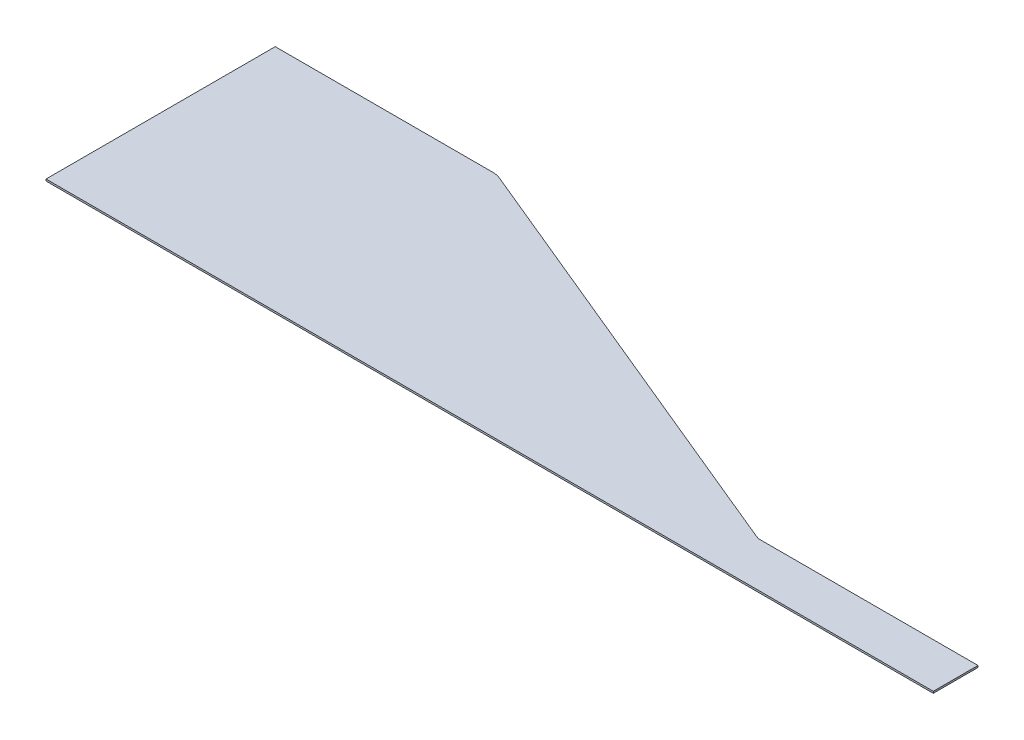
ISO-10303-21;
HEADER;
FILE_DESCRIPTION(('STEP AP214'),'2;1');
FILE_NAME('part.step','',(''),(''),'','','');
FILE_SCHEMA(('AUTOMOTIVE_DESIGN { 1 0 10303 214 1 1 1 1 }'));
ENDSEC;
DATA;
#1=APPLICATION_CONTEXT('core data for automotive mechanical design processes');
#2=APPLICATION_PROTOCOL_DEFINITION('international standard','automotive_design',2000,#1);
#3=PRODUCT_CONTEXT('',#1,'mechanical');
#4=PRODUCT('Part','Part','',(#3));
#5=PRODUCT_RELATED_PRODUCT_CATEGORY('part','',(#4));
#6=PRODUCT_DEFINITION_FORMATION('','',#4);
#7=PRODUCT_DEFINITION_CONTEXT('part definition',#1,'design');
#8=PRODUCT_DEFINITION('design','',#6,#7);
#9=PRODUCT_DEFINITION_SHAPE('','',#8);
#10=(LENGTH_UNIT() NAMED_UNIT(*) SI_UNIT(.MILLI.,.METRE.));
#11=(NAMED_UNIT(*) PLANE_ANGLE_UNIT() SI_UNIT($,.RADIAN.));
#12=(NAMED_UNIT(*) SI_UNIT($,.STERADIAN.) SOLID_ANGLE_UNIT());
#13=UNCERTAINTY_MEASURE_WITH_UNIT(LENGTH_MEASURE(1.E-05),#10,'distance_accuracy_value','');
#14=(GEOMETRIC_REPRESENTATION_CONTEXT(3) GLOBAL_UNCERTAINTY_ASSIGNED_CONTEXT((#13)) GLOBAL_UNIT_ASSIGNED_CONTEXT((#10,
#11,#12)) REPRESENTATION_CONTEXT('',''));
#15=CARTESIAN_POINT('',(0.,0.,0.));
#16=DIRECTION('',(0.,0.,1.));
#17=DIRECTION('',(1.,0.,0.));
#18=AXIS2_PLACEMENT_3D('',#15,#16,#17);
#19=CARTESIAN_POINT('',(0.,250.,300.));
#20=DIRECTION('',(0.,1.,0.));
#21=DIRECTION('',(0.,0.,1.));
#22=AXIS2_PLACEMENT_3D('',#19,#20,#21);
#23=PLANE('',#22);
#24=DIRECTION('',(1.,0.,0.));
#25=VECTOR('',#24,1.);
#26=CARTESIAN_POINT('',(0.,250.,300.));
#27=LINE('',#26,#25);
#28=CARTESIAN_POINT('',(-245.98048628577,250.,300.));
#29=VERTEX_POINT('',#28);
#30=CARTESIAN_POINT('',(745.98048628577,250.,300.));
#31=VERTEX_POINT('',#30);
#32=EDGE_CURVE('E161',#29,#31,#27,.T.);
#33=ORIENTED_EDGE('',*,*,#32,.T.);
#34=DIRECTION('',(0.,0.,-1.));
#35=VECTOR('',#34,1.);
#36=CARTESIAN_POINT('',(745.98048628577,250.,300.));
#37=LINE('',#36,#35);
#38=CARTESIAN_POINT('',(745.98048628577,250.,250.));
#39=VERTEX_POINT('',#38);
#40=EDGE_CURVE('E128',#31,#39,#37,.T.);
#41=ORIENTED_EDGE('',*,*,#40,.T.);
#42=DIRECTION('',(1.,0.,0.));
#43=VECTOR('',#42,1.);
#44=CARTESIAN_POINT('',(-297.055609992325,250.,250.));
#45=LINE('',#44,#43);
#46=CARTESIAN_POINT('',(500.58048628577,250.,250.));
#47=VERTEX_POINT('',#46);
#48=EDGE_CURVE('E122',#47,#39,#45,.T.);
#49=ORIENTED_EDGE('',*,*,#48,.F.);
#50=DIRECTION('',(-0.938532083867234,0.,-0.345192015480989));
#51=VECTOR('',#50,1.);
#52=CARTESIAN_POINT('',(500.58048628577,250.,250.));
#53=LINE('',#52,#51);
#54=CARTESIAN_POINT('',(495.4,250.,248.094617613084));
#55=VERTEX_POINT('',#54);
#56=EDGE_CURVE('E125',#47,#55,#53,.T.);
#57=ORIENTED_EDGE('',*,*,#56,.T.);
#58=DIRECTION('',(0.923879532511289,0.,0.382683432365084));
#59=VECTOR('',#58,1.);
#60=CARTESIAN_POINT('',(90.9009742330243,250.,80.5456351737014));
#61=LINE('',#60,#59);
#62=CARTESIAN_POINT('',(4.6,250.,44.7986012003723));
#63=VERTEX_POINT('',#62);
#64=EDGE_CURVE('E157',#63,#55,#61,.T.);
#65=ORIENTED_EDGE('',*,*,#64,.F.);
#66=DIRECTION('',(-0.979067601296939,0.,-0.203535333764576));
#67=VECTOR('',#66,1.);
#68=CARTESIAN_POINT('',(4.6,250.,44.7986012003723));
#69=LINE('',#68,#67);
#70=CARTESIAN_POINT('',(-0.580486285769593,250.,43.7216459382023));
#71=VERTEX_POINT('',#70);
#72=EDGE_CURVE('E154',#63,#71,#69,.T.);
#73=ORIENTED_EDGE('',*,*,#72,.T.);
#74=DIRECTION('',(1.,0.,0.));
#75=VECTOR('',#74,1.);
#76=CARTESIAN_POINT('',(-245.98048628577,250.,43.7216459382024));
#77=LINE('',#76,#75);
#78=CARTESIAN_POINT('',(-245.98048628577,250.,43.7216459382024));
#79=VERTEX_POINT('',#78);
#80=EDGE_CURVE('E62',#79,#71,#77,.T.);
#81=ORIENTED_EDGE('',*,*,#80,.F.);
#82=DIRECTION('',(0.,0.,-1.));
#83=VECTOR('',#82,1.);
#84=CARTESIAN_POINT('',(-245.98048628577,250.,300.));
#85=LINE('',#84,#83);
#86=EDGE_CURVE('E138',#29,#79,#85,.T.);
#87=ORIENTED_EDGE('',*,*,#86,.F.);
#88=EDGE_LOOP('',(#33,#41,#49,#57,#65,#73,#81,#87));
#89=FACE_BOUND('',#88,.T.);
#90=ADVANCED_FACE('F39',(#89),#23,.T.);
#91=CARTESIAN_POINT('',(0.,248.,300.));
#92=DIRECTION('',(0.,1.,0.));
#93=DIRECTION('',(0.,0.,1.));
#94=AXIS2_PLACEMENT_3D('',#91,#92,#93);
#95=PLANE('',#94);
#96=DIRECTION('',(0.923879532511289,0.,0.382683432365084));
#97=VECTOR('',#96,1.);
#98=CARTESIAN_POINT('',(90.9009742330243,248.,80.5456351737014));
#99=LINE('',#98,#97);
#100=CARTESIAN_POINT('',(4.6,248.,44.7986012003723));
#101=VERTEX_POINT('',#100);
#102=CARTESIAN_POINT('',(495.4,248.,248.094617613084));
#103=VERTEX_POINT('',#102);
#104=EDGE_CURVE('E159',#101,#103,#99,.T.);
#105=ORIENTED_EDGE('',*,*,#104,.T.);
#106=DIRECTION('',(-0.938532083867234,0.,-0.345192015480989));
#107=VECTOR('',#106,1.);
#108=CARTESIAN_POINT('',(500.58048628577,248.,250.));
#109=LINE('',#108,#107);
#110=CARTESIAN_POINT('',(500.58048628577,248.,250.));
#111=VERTEX_POINT('',#110);
#112=EDGE_CURVE('E53',#111,#103,#109,.T.);
#113=ORIENTED_EDGE('',*,*,#112,.F.);
#114=DIRECTION('',(-1.,0.,0.));
#115=VECTOR('',#114,1.);
#116=CARTESIAN_POINT('',(495.98048628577,248.,250.));
#117=LINE('',#116,#115);
#118=CARTESIAN_POINT('',(745.98048628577,248.,250.));
#119=VERTEX_POINT('',#118);
#120=EDGE_CURVE('E129',#111,#119,#117,.F.);
#121=ORIENTED_EDGE('',*,*,#120,.T.);
#122=DIRECTION('',(0.,0.,-1.));
#123=VECTOR('',#122,1.);
#124=CARTESIAN_POINT('',(745.98048628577,248.,300.));
#125=LINE('',#124,#123);
#126=CARTESIAN_POINT('',(745.98048628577,248.,300.));
#127=VERTEX_POINT('',#126);
#128=EDGE_CURVE('E133',#127,#119,#125,.T.);
#129=ORIENTED_EDGE('',*,*,#128,.F.);
#130=DIRECTION('',(1.,0.,0.));
#131=VECTOR('',#130,1.);
#132=CARTESIAN_POINT('',(0.,248.,300.));
#133=LINE('',#132,#131);
#134=CARTESIAN_POINT('',(-245.98048628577,248.,300.));
#135=VERTEX_POINT('',#134);
#136=EDGE_CURVE('E94',#135,#127,#133,.T.);
#137=ORIENTED_EDGE('',*,*,#136,.F.);
#138=DIRECTION('',(0.,0.,-1.));
#139=VECTOR('',#138,1.);
#140=CARTESIAN_POINT('',(-245.98048628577,248.,300.));
#141=LINE('',#140,#139);
#142=CARTESIAN_POINT('',(-245.98048628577,248.,43.7216459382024));
#143=VERTEX_POINT('',#142);
#144=EDGE_CURVE('E143',#135,#143,#141,.T.);
#145=ORIENTED_EDGE('',*,*,#144,.T.);
#146=DIRECTION('',(1.,0.,0.));
#147=VECTOR('',#146,1.);
#148=CARTESIAN_POINT('',(-245.98048628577,248.,43.7216459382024));
#149=LINE('',#148,#147);
#150=CARTESIAN_POINT('',(-0.580486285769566,248.,43.7216459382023));
#151=VERTEX_POINT('',#150);
#152=EDGE_CURVE('E97',#143,#151,#149,.T.);
#153=ORIENTED_EDGE('',*,*,#152,.T.);
#154=DIRECTION('',(-0.979067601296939,0.,-0.203535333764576));
#155=VECTOR('',#154,1.);
#156=CARTESIAN_POINT('',(4.6,248.,44.7986012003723));
#157=LINE('',#156,#155);
#158=EDGE_CURVE('E145',#101,#151,#157,.T.);
#159=ORIENTED_EDGE('',*,*,#158,.F.);
#160=EDGE_LOOP('',(#105,#113,#121,#129,#137,#145,#153,#159));
#161=FACE_BOUND('',#160,.T.);
#162=ADVANCED_FACE('F171',(#161),#95,.F.);
#163=CARTESIAN_POINT('',(2.,245.4,300.));
#164=DIRECTION('',(0.,0.,1.));
#165=DIRECTION('',(1.,0.,0.));
#166=AXIS2_PLACEMENT_3D('',#163,#164,#165);
#167=PLANE('',#166);
#168=ORIENTED_EDGE('',*,*,#32,.F.);
#169=DIRECTION('',(0.,1.,0.));
#170=VECTOR('',#169,1.);
#171=CARTESIAN_POINT('',(-245.98048628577,248.,300.));
#172=LINE('',#171,#170);
#173=EDGE_CURVE('E149',#135,#29,#172,.T.);
#174=ORIENTED_EDGE('',*,*,#173,.F.);
#175=ORIENTED_EDGE('',*,*,#136,.T.);
#176=DIRECTION('',(0.,-1.,0.));
#177=VECTOR('',#176,1.);
#178=CARTESIAN_POINT('',(745.98048628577,250.,300.));
#179=LINE('',#178,#177);
#180=EDGE_CURVE('E169',#31,#127,#179,.T.);
#181=ORIENTED_EDGE('',*,*,#180,.F.);
#182=EDGE_LOOP('',(#168,#174,#175,#181));
#183=FACE_BOUND('',#182,.T.);
#184=ADVANCED_FACE('F167',(#183),#167,.T.);
#185=CARTESIAN_POINT('',(90.9009742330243,250.,80.5456351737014));
#186=DIRECTION('',(-0.382683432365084,0.,0.923879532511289));
#187=DIRECTION('',(0.923879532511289,0.,0.382683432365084));
#188=AXIS2_PLACEMENT_3D('',#185,#186,#187);
#189=PLANE('',#188);
#190=ORIENTED_EDGE('',*,*,#64,.T.);
#191=DIRECTION('',(0.,-1.,0.));
#192=VECTOR('',#191,1.);
#193=CARTESIAN_POINT('',(495.4,250.,248.094617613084));
#194=LINE('',#193,#192);
#195=EDGE_CURVE('E12',#55,#103,#194,.T.);
#196=ORIENTED_EDGE('',*,*,#195,.T.);
#197=ORIENTED_EDGE('',*,*,#104,.F.);
#198=DIRECTION('',(0.,-1.,0.));
#199=VECTOR('',#198,1.);
#200=CARTESIAN_POINT('',(4.6,250.,44.7986012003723));
#201=LINE('',#200,#199);
#202=EDGE_CURVE('E46',#63,#101,#201,.T.);
#203=ORIENTED_EDGE('',*,*,#202,.F.);
#204=EDGE_LOOP('',(#190,#196,#197,#203));
#205=FACE_BOUND('',#204,.T.);
#206=ADVANCED_FACE('F197',(#205),#189,.F.);
#207=CARTESIAN_POINT('',(4.6,249.302,44.7986012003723));
#208=DIRECTION('',(0.203535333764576,0.,-0.979067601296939));
#209=DIRECTION('',(-0.979067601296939,0.,-0.203535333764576));
#210=AXIS2_PLACEMENT_3D('',#207,#208,#209);
#211=PLANE('',#210);
#212=ORIENTED_EDGE('',*,*,#202,.T.);
#213=ORIENTED_EDGE('',*,*,#158,.T.);
#214=DIRECTION('',(0.,1.,0.));
#215=VECTOR('',#214,1.);
#216=CARTESIAN_POINT('',(-0.580486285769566,248.,43.7216459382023));
#217=LINE('',#216,#215);
#218=EDGE_CURVE('E136',#151,#71,#217,.T.);
#219=ORIENTED_EDGE('',*,*,#218,.T.);
#220=ORIENTED_EDGE('',*,*,#72,.F.);
#221=EDGE_LOOP('',(#212,#213,#219,#220));
#222=FACE_BOUND('',#221,.T.);
#223=ADVANCED_FACE('F201',(#222),#211,.T.);
#224=CARTESIAN_POINT('',(-245.98048628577,248.,300.));
#225=DIRECTION('',(-1.,0.,0.));
#226=DIRECTION('',(0.,0.,-1.));
#227=AXIS2_PLACEMENT_3D('',#224,#225,#226);
#228=PLANE('',#227);
#229=ORIENTED_EDGE('',*,*,#86,.T.);
#230=DIRECTION('',(0.,-1.,0.));
#231=VECTOR('',#230,1.);
#232=CARTESIAN_POINT('',(-245.98048628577,248.,43.7216459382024));
#233=LINE('',#232,#231);
#234=EDGE_CURVE('E80',#143,#79,#233,.F.);
#235=ORIENTED_EDGE('',*,*,#234,.F.);
#236=ORIENTED_EDGE('',*,*,#144,.F.);
#237=ORIENTED_EDGE('',*,*,#173,.T.);
#238=EDGE_LOOP('',(#229,#235,#236,#237));
#239=FACE_BOUND('',#238,.T.);
#240=ADVANCED_FACE('F205',(#239),#228,.T.);
#241=CARTESIAN_POINT('',(-245.98048628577,248.,43.7216459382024));
#242=DIRECTION('',(0.,0.,1.));
#243=DIRECTION('',(1.,0.,0.));
#244=AXIS2_PLACEMENT_3D('',#241,#242,#243);
#245=PLANE('',#244);
#246=ORIENTED_EDGE('',*,*,#218,.F.);
#247=ORIENTED_EDGE('',*,*,#152,.F.);
#248=ORIENTED_EDGE('',*,*,#234,.T.);
#249=ORIENTED_EDGE('',*,*,#80,.T.);
#250=EDGE_LOOP('',(#246,#247,#248,#249));
#251=FACE_BOUND('',#250,.T.);
#252=ADVANCED_FACE('F186',(#251),#245,.F.);
#253=CARTESIAN_POINT('',(500.58048628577,249.302,250.));
#254=DIRECTION('',(0.345192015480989,0.,-0.938532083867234));
#255=DIRECTION('',(-0.938532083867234,0.,-0.345192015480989));
#256=AXIS2_PLACEMENT_3D('',#253,#254,#255);
#257=PLANE('',#256);
#258=ORIENTED_EDGE('',*,*,#112,.T.);
#259=ORIENTED_EDGE('',*,*,#195,.F.);
#260=ORIENTED_EDGE('',*,*,#56,.F.);
#261=DIRECTION('',(0.,-1.,0.));
#262=VECTOR('',#261,1.);
#263=CARTESIAN_POINT('',(500.58048628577,250.,250.));
#264=LINE('',#263,#262);
#265=EDGE_CURVE('E131',#47,#111,#264,.T.);
#266=ORIENTED_EDGE('',*,*,#265,.T.);
#267=EDGE_LOOP('',(#258,#259,#260,#266));
#268=FACE_BOUND('',#267,.T.);
#269=ADVANCED_FACE('F135',(#268),#257,.T.);
#270=CARTESIAN_POINT('',(745.98048628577,250.,300.));
#271=DIRECTION('',(1.,0.,0.));
#272=DIRECTION('',(0.,1.,0.));
#273=AXIS2_PLACEMENT_3D('',#270,#271,#272);
#274=PLANE('',#273);
#275=ORIENTED_EDGE('',*,*,#128,.T.);
#276=DIRECTION('',(0.,1.,0.));
#277=VECTOR('',#276,1.);
#278=CARTESIAN_POINT('',(745.98048628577,250.,250.));
#279=LINE('',#278,#277);
#280=EDGE_CURVE('E108',#39,#119,#279,.F.);
#281=ORIENTED_EDGE('',*,*,#280,.F.);
#282=ORIENTED_EDGE('',*,*,#40,.F.);
#283=ORIENTED_EDGE('',*,*,#180,.T.);
#284=EDGE_LOOP('',(#275,#281,#282,#283));
#285=FACE_BOUND('',#284,.T.);
#286=ADVANCED_FACE('F173',(#285),#274,.T.);
#287=CARTESIAN_POINT('',(-297.055609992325,250.,250.));
#288=DIRECTION('',(0.,0.,1.));
#289=DIRECTION('',(1.,0.,0.));
#290=AXIS2_PLACEMENT_3D('',#287,#288,#289);
#291=PLANE('',#290);
#292=ORIENTED_EDGE('',*,*,#48,.T.);
#293=ORIENTED_EDGE('',*,*,#280,.T.);
#294=ORIENTED_EDGE('',*,*,#120,.F.);
#295=ORIENTED_EDGE('',*,*,#265,.F.);
#296=EDGE_LOOP('',(#292,#293,#294,#295));
#297=FACE_BOUND('',#296,.T.);
#298=ADVANCED_FACE('F132',(#297),#291,.F.);
#299=CLOSED_SHELL('',(#90,#162,#184,#206,#223,#240,#252,#269,#286,#298));
#300=MANIFOLD_SOLID_BREP('B2',#299);
#301=ADVANCED_BREP_SHAPE_REPRESENTATION('',(#18,#300),#14);
#302=SHAPE_DEFINITION_REPRESENTATION(#9,#301);
ENDSEC;
END-ISO-10303-21;
